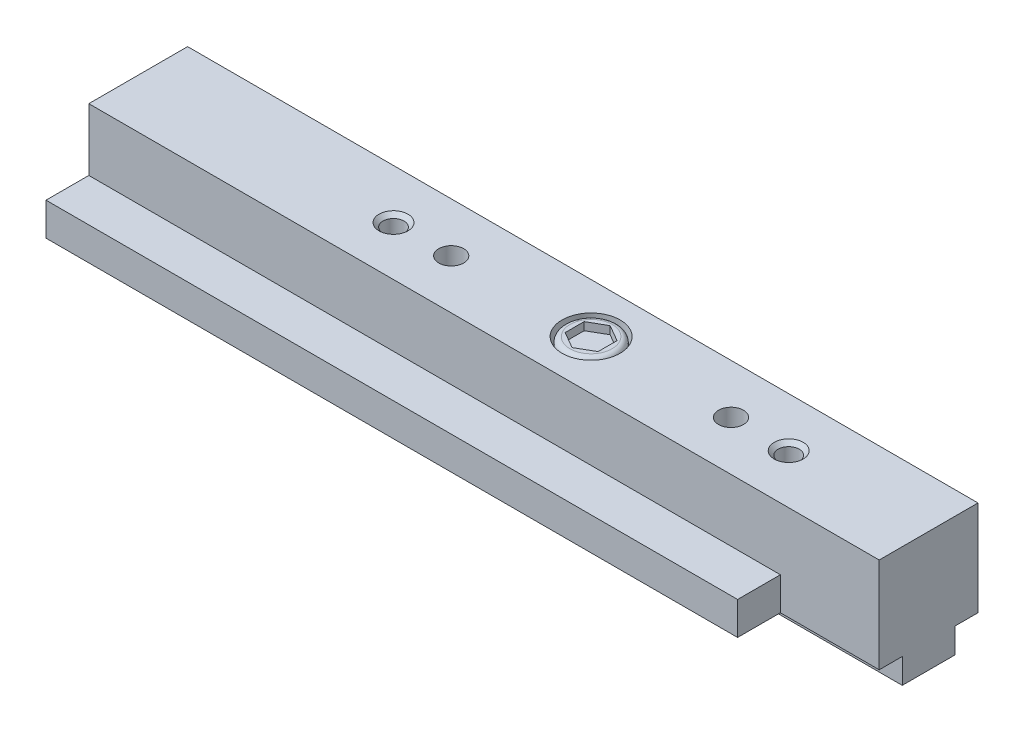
from build123d import *

# Parameters (mm, degrees)
EXTRUDE1_DEPTH     = 66.675
EXTRUDE2_DEPTH     = 9.525
SKETCH5_R          = 1.20269
CUT_EXTRUDE1_DEPTH = 3.048
SKETCH6_R          = 1.20269
CUT_EXTRUDE2_DEPTH = 3.048
SKETCH7_R          = 2.794
CUT_EXTRUDE3_DEPTH = 1.524
CUT_EXTRUDE4_DEPTH = 0.762


with BuildPart() as part:
    # Sketch1 → Extrude1 (new body)
    with BuildSketch(Plane(origin=(0, 0, 0), x_dir=(0, 0, -1), z_dir=(1, 0, 0))):
        Polygon((-8.89, 2.413), (-2.54, 2.413), (-2.54, 0), (2.54, 0), (2.54, 2.413), (8.89, 2.413), (8.89, 5.588), (4.7625, 5.588), (4.7625, 11.5824), (-4.7625, 11.5824), (-4.7625, 5.588), (-8.89, 5.588), align=None)
    extrude(amount=EXTRUDE1_DEPTH)

    # Sketch2 → Extrude2 (add)
    with BuildSketch(Plane(origin=(66.675, 0, 0), x_dir=(0, 0, -1), z_dir=(1, 0, 0))):
        Polygon((-4.7625, 2.413), (-2.54, 2.413), (-2.54, 0), (2.54, 0), (2.54, 2.413), (4.7625, 2.413), (4.7625, 11.5824), (-4.7625, 11.5824), align=None)
    extrude(amount=EXTRUDE2_DEPTH)

    # Sketch3 → Cut-Revolve1 (revolve, cut)
    with BuildSketch(Plane(origin=(62.7126, 0, 0), x_dir=(0, 0, -1), z_dir=(1, 0, 0)), mode=Mode.PRIVATE) as cut_revolve1_sk:
        Polygon((0, 11.5824), (1.397, 11.5824), (1.016, 11.2014), (1.016, 3.913987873), (0, 3.3274), align=None)
    revolve(cut_revolve1_sk.sketch.rotate(Axis((62.7126, 3.3274, 0), (0, 1, 0)), 180), axis=Axis((62.7126, 3.3274, 0), (0, 1, 0)), mode=Mode.SUBTRACT)

    # Sketch4 → Cut-Revolve2 (revolve, cut)
    with BuildSketch(Plane(origin=(24.6126, 0, 0), x_dir=(0, 0, -1), z_dir=(1, 0, 0)), mode=Mode.PRIVATE) as cut_revolve2_sk:
        Polygon((0, 11.5824), (1.397, 11.5824), (1.016, 11.2014), (1.016, 3.913987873), (0, 3.3274), align=None)
    revolve(cut_revolve2_sk.sketch.rotate(Axis((24.6126, 3.3274, 0), (0, 1, 0)), 180), axis=Axis((24.6126, 3.3274, 0), (0, 1, 0)), mode=Mode.SUBTRACT)

    # Sketch5 → Cut-Extrude1 (cut)
    with BuildSketch(Plane(origin=(0, 11.5824, 0), x_dir=(-1, 0, 0), z_dir=(0, 1, 0))):
        with Locations(Location((-57.15, 0, 0), (0, 0, 90))):
            Circle(SKETCH5_R)
    extrude(amount=-CUT_EXTRUDE1_DEPTH, mode=Mode.SUBTRACT)

    # Sketch6 → Cut-Extrude2 (cut)
    with BuildSketch(Plane(origin=(0, 11.5824, 0), x_dir=(-1, 0, 0), z_dir=(0, 1, 0))):
        with Locations(Location((-30.1752, 0, 0), (0, 0, 90))):
            Circle(SKETCH6_R)
    extrude(amount=-CUT_EXTRUDE2_DEPTH, mode=Mode.SUBTRACT)

    # Sketch7 → Cut-Extrude3 (cut)
    with BuildSketch(Plane(origin=(0, 11.5824, 0), x_dir=(-1, 0, 0), z_dir=(0, 1, 0))):
        with Locations(Location((-43.6626, 0, 0), (0, 0, 90))):
            Circle(SKETCH7_R)
    extrude(amount=-CUT_EXTRUDE3_DEPTH, mode=Mode.SUBTRACT)

    # Sketch8 → Revolve1 (revolve)
    with BuildSketch(Plane(origin=(43.6626, 0, 0), x_dir=(0, 0, -1), z_dir=(1, 0, 0)), mode=Mode.PRIVATE) as revolve1_sk:
        with BuildLine():
            Line((0, 11.5824), (2.032, 11.5824))
            ThreePointArc((2.032, 11.5824), (2.391210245, 11.433610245), (2.54, 11.0744))
            Line((2.54, 11.0744), (2.54, 10.0584))
            Line((2.54, 10.0584), (0, 10.0584))
            Line((0, 10.0584), (0, 11.5824))
        make_face()
    revolve(revolve1_sk.sketch.rotate(Axis((43.6626, 10.0584, 0), (0, 1, 0)), 180), axis=Axis((43.6626, 10.0584, 0), (0, 1, 0)))

    # Sketch9 → Cut-Extrude4 (cut)
    with BuildSketch(Plane(origin=(0, 11.5824, 0), x_dir=(-1, 0, 0), z_dir=(0, 1, 0))):
        Polygon((-42.0751, -0.916543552), (-42.0751, 0.916543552), (-43.6626, 1.833087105), (-45.2501, 0.916543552), (-45.2501, -0.916543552), (-43.6626, -1.833087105), align=None)
    extrude(amount=-CUT_EXTRUDE4_DEPTH, mode=Mode.SUBTRACT)


solid = part.part
